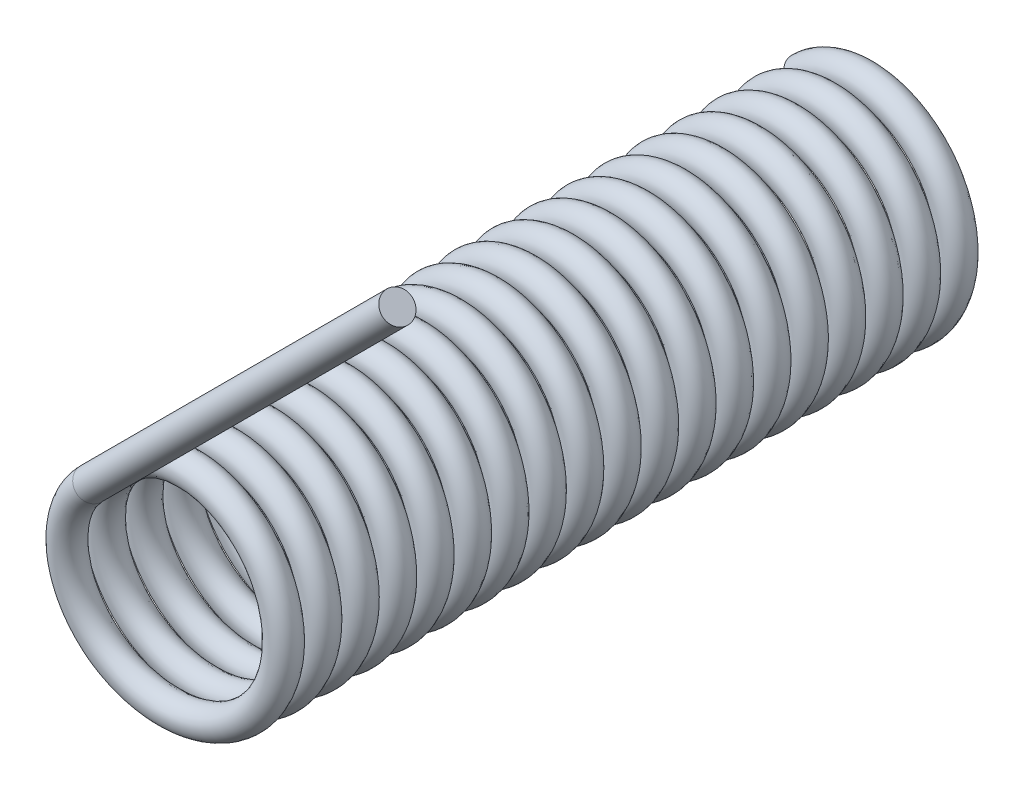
from build123d import *

# Parameters (mm, degrees)
SWEEP2_PITCH       = 1.503947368
SWEEP2_HEIGHT      = 28.574999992
SWEEP2_RADIUS      = 3.96875
SWEEP2_START_ANGLE = 135
SKETCH3_R          = 0.5953125
SKETCH4_R          = 0.5953125
EXTRUDE1_DEPTH     = 19.05


with BuildPart() as part:
    # Sweep2: sweep along a helix
    with BuildLine() as sweep2_path:
        add(Helix(SWEEP2_PITCH, SWEEP2_HEIGHT, SWEEP2_RADIUS, center=(-35.574042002, 18.112790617, 0), direction=(0, 0, 1), lefthand=True, mode=Mode.PRIVATE).rotate(Axis((-35.574042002, 18.112790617, 0), (0, 0, 1)), SWEEP2_START_ANGLE))
    # Sketch3 → Sweep2 (sweep)
    with BuildSketch(Plane(origin=(-38.38037204, 20.919120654, 28.574999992), x_dir=(0.04256921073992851, 0.04256921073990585, -0.9981862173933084), z_dir=(0.7058242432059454, 0.7058242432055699, 0.06020195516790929))):
        with Locations((-0.000102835, -9.704e-05)):
            Circle(SKETCH3_R)
    sweep(path=sweep2_path.line, is_frenet=True)

    # Sketch4 → Extrude1 (add)
    with BuildSketch(Plane(origin=(-7.484774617, -7.484774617, -0.638399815), x_dir=(0.042569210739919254, 0.0425692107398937, -0.9981862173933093), z_dir=(0.7058242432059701, 0.7058242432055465, 0.06020195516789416))):
        with Locations(Location((-29.26658568, 41.930976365, 0), (0, 0, 90))):
            Circle(SKETCH4_R)
    extrude(amount=EXTRUDE1_DEPTH)


solid = part.part
